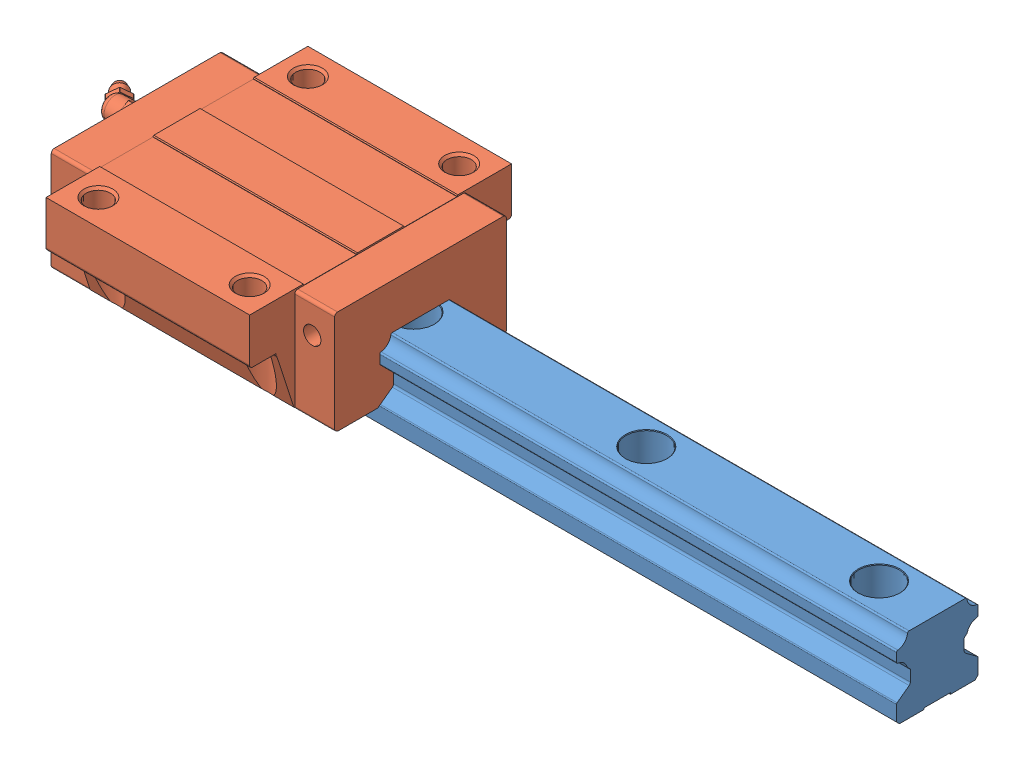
SolidWorks assembly HLW30CC.stp.sldasm, configuration 默认 (file format 13000). Lengths in mm.
Overall size (289.43 42 90).
2 component instances, 2 part files, 0 mates.
Components (placement in the parent):
- HLR30R280 E=20-1: HLR30R280 E=20.SLDPRT [默认] at origin size (280 26 28)
- HLW30CC-1: HLW30CC.SLDPRT [默认] at (5 6 0) size (111.83 36 90)
